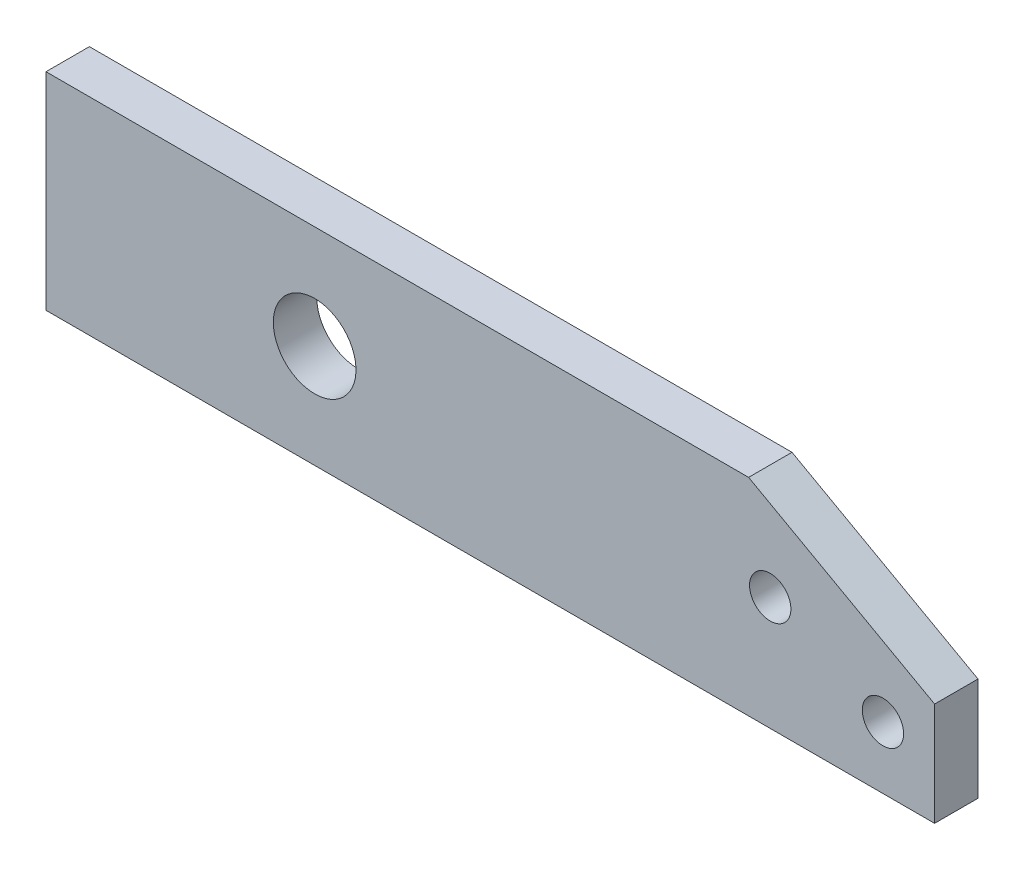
from build123d import *

# Parameters (mm, degrees)
ESQUISSE1_R      = 10
ESQUISSE1_R_2    = 20
EXTRUSION1_DEPTH = 21


with BuildPart() as part:
    # Esquisse1 → Extrusion1 (new body)
    with BuildSketch(Plane.XY):
        Polygon((340, 0), (430, -50), (430, -100), (0, -100), (0, 0), align=None)
        with Locations(Location((405, -70, 0), (0, 0, 180))):
            Circle(ESQUISSE1_R, mode=Mode.SUBTRACT)
        with Locations(Location((350.456439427, -45, 0), (0, 0, 180))):
            Circle(ESQUISSE1_R, mode=Mode.SUBTRACT)
        with Locations(Location((130, -50, 0), (0, 0, 180))):
            Circle(ESQUISSE1_R_2, mode=Mode.SUBTRACT)
    extrude(amount=EXTRUSION1_DEPTH)


solid = part.part
